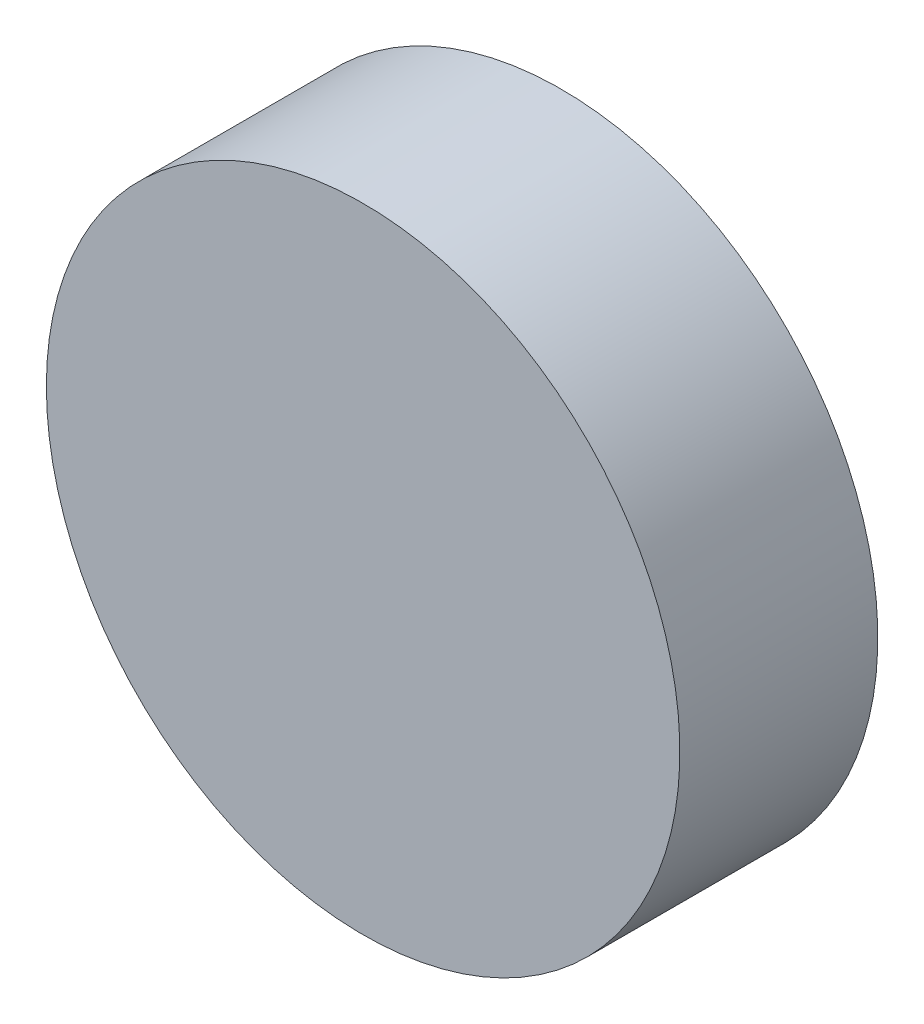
ISO-10303-21;
HEADER;
FILE_DESCRIPTION(('STEP AP214'),'2;1');
FILE_NAME('part.step','',(''),(''),'','','');
FILE_SCHEMA(('AUTOMOTIVE_DESIGN { 1 0 10303 214 1 1 1 1 }'));
ENDSEC;
DATA;
#1=APPLICATION_CONTEXT('core data for automotive mechanical design processes');
#2=APPLICATION_PROTOCOL_DEFINITION('international standard','automotive_design',2000,#1);
#3=PRODUCT_CONTEXT('',#1,'mechanical');
#4=PRODUCT('Part','Part','',(#3));
#5=PRODUCT_RELATED_PRODUCT_CATEGORY('part','',(#4));
#6=PRODUCT_DEFINITION_FORMATION('','',#4);
#7=PRODUCT_DEFINITION_CONTEXT('part definition',#1,'design');
#8=PRODUCT_DEFINITION('design','',#6,#7);
#9=PRODUCT_DEFINITION_SHAPE('','',#8);
#10=(LENGTH_UNIT() NAMED_UNIT(*) SI_UNIT(.MILLI.,.METRE.));
#11=(NAMED_UNIT(*) PLANE_ANGLE_UNIT() SI_UNIT($,.RADIAN.));
#12=(NAMED_UNIT(*) SI_UNIT($,.STERADIAN.) SOLID_ANGLE_UNIT());
#13=UNCERTAINTY_MEASURE_WITH_UNIT(LENGTH_MEASURE(1.E-05),#10,'distance_accuracy_value','');
#14=(GEOMETRIC_REPRESENTATION_CONTEXT(3) GLOBAL_UNCERTAINTY_ASSIGNED_CONTEXT((#13)) GLOBAL_UNIT_ASSIGNED_CONTEXT((#10,
#11,#12)) REPRESENTATION_CONTEXT('',''));
#15=CARTESIAN_POINT('',(0.,0.,0.));
#16=DIRECTION('',(0.,0.,1.));
#17=DIRECTION('',(1.,0.,0.));
#18=AXIS2_PLACEMENT_3D('',#15,#16,#17);
#19=CARTESIAN_POINT('',(0.,0.,5.7866935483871));
#20=DIRECTION('',(0.,0.,1.));
#21=DIRECTION('',(1.,0.,0.));
#22=AXIS2_PLACEMENT_3D('',#19,#20,#21);
#23=PLANE('',#22);
#24=CARTESIAN_POINT('',(0.,0.,5.7866935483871));
#25=DIRECTION('',(0.,0.,-1.));
#26=DIRECTION('',(-1.,0.,0.));
#27=AXIS2_PLACEMENT_3D('',#24,#25,#26);
#28=CIRCLE('',#27,5.55625);
#29=CARTESIAN_POINT('',(-5.55625,0.,5.7866935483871));
#30=VERTEX_POINT('',#29);
#31=EDGE_CURVE('E33',#30,#30,#28,.T.);
#32=ORIENTED_EDGE('',*,*,#31,.T.);
#33=EDGE_LOOP('',(#32));
#34=FACE_BOUND('',#33,.T.);
#35=ADVANCED_FACE('F30',(#34),#23,.F.);
#36=CARTESIAN_POINT('',(0.,0.,5.7866935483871));
#37=DIRECTION('',(0.,0.,-1.));
#38=DIRECTION('',(-1.,0.,0.));
#39=AXIS2_PLACEMENT_3D('',#36,#37,#38);
#40=CYLINDRICAL_SURFACE('',#39,5.55625);
#41=CARTESIAN_POINT('',(0.,0.,2.6116935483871));
#42=DIRECTION('',(0.,0.,-1.));
#43=DIRECTION('',(-1.,0.,0.));
#44=AXIS2_PLACEMENT_3D('',#41,#42,#43);
#45=CIRCLE('',#44,5.55625);
#46=CARTESIAN_POINT('',(-5.55625,0.,2.6116935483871));
#47=VERTEX_POINT('',#46);
#48=EDGE_CURVE('E42',#47,#47,#45,.T.);
#49=ORIENTED_EDGE('',*,*,#48,.T.);
#50=EDGE_LOOP('',(#49));
#51=FACE_BOUND('',#50,.T.);
#52=ORIENTED_EDGE('',*,*,#31,.F.);
#53=EDGE_LOOP('',(#52));
#54=FACE_BOUND('',#53,.T.);
#55=ADVANCED_FACE('F51',(#51,#54),#40,.F.);
#56=CARTESIAN_POINT('',(0.,0.,2.6116935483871));
#57=DIRECTION('',(0.,0.,1.));
#58=DIRECTION('',(1.,0.,0.));
#59=AXIS2_PLACEMENT_3D('',#56,#57,#58);
#60=PLANE('',#59);
#61=ORIENTED_EDGE('',*,*,#48,.F.);
#62=EDGE_LOOP('',(#61));
#63=FACE_BOUND('',#62,.T.);
#64=CARTESIAN_POINT('',(0.,0.,2.6116935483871));
#65=DIRECTION('',(0.,0.,-1.));
#66=DIRECTION('',(-1.,0.,0.));
#67=AXIS2_PLACEMENT_3D('',#64,#65,#66);
#68=CIRCLE('',#67,6.35);
#69=CARTESIAN_POINT('',(-6.35,0.,2.6116935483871));
#70=VERTEX_POINT('',#69);
#71=EDGE_CURVE('E37',#70,#70,#68,.F.);
#72=ORIENTED_EDGE('',*,*,#71,.F.);
#73=EDGE_LOOP('',(#72));
#74=FACE_BOUND('',#73,.T.);
#75=ADVANCED_FACE('F53',(#63,#74),#60,.F.);
#76=CARTESIAN_POINT('',(0.,0.,5.7866935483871));
#77=DIRECTION('',(0.,0.,-1.));
#78=DIRECTION('',(-1.,0.,0.));
#79=AXIS2_PLACEMENT_3D('',#76,#77,#78);
#80=CYLINDRICAL_SURFACE('',#79,6.35);
#81=ORIENTED_EDGE('',*,*,#71,.T.);
#82=EDGE_LOOP('',(#81));
#83=FACE_BOUND('',#82,.T.);
#84=CARTESIAN_POINT('',(0.,0.,6.5804435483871));
#85=DIRECTION('',(0.,0.,-1.));
#86=DIRECTION('',(-1.,0.,0.));
#87=AXIS2_PLACEMENT_3D('',#84,#85,#86);
#88=CIRCLE('',#87,6.35);
#89=CARTESIAN_POINT('',(-6.35,0.,6.5804435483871));
#90=VERTEX_POINT('',#89);
#91=EDGE_CURVE('E10',#90,#90,#88,.F.);
#92=ORIENTED_EDGE('',*,*,#91,.F.);
#93=EDGE_LOOP('',(#92));
#94=FACE_BOUND('',#93,.T.);
#95=ADVANCED_FACE('F58',(#83,#94),#80,.T.);
#96=CARTESIAN_POINT('',(0.,0.,6.5804435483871));
#97=DIRECTION('',(0.,0.,1.));
#98=DIRECTION('',(1.,0.,0.));
#99=AXIS2_PLACEMENT_3D('',#96,#97,#98);
#100=PLANE('',#99);
#101=ORIENTED_EDGE('',*,*,#91,.T.);
#102=EDGE_LOOP('',(#101));
#103=FACE_BOUND('',#102,.T.);
#104=ADVANCED_FACE('F61',(#103),#100,.T.);
#105=CLOSED_SHELL('',(#35,#55,#75,#95,#104));
#106=MANIFOLD_SOLID_BREP('B2',#105);
#107=ADVANCED_BREP_SHAPE_REPRESENTATION('',(#18,#106),#14);
#108=SHAPE_DEFINITION_REPRESENTATION(#9,#107);
ENDSEC;
END-ISO-10303-21;
